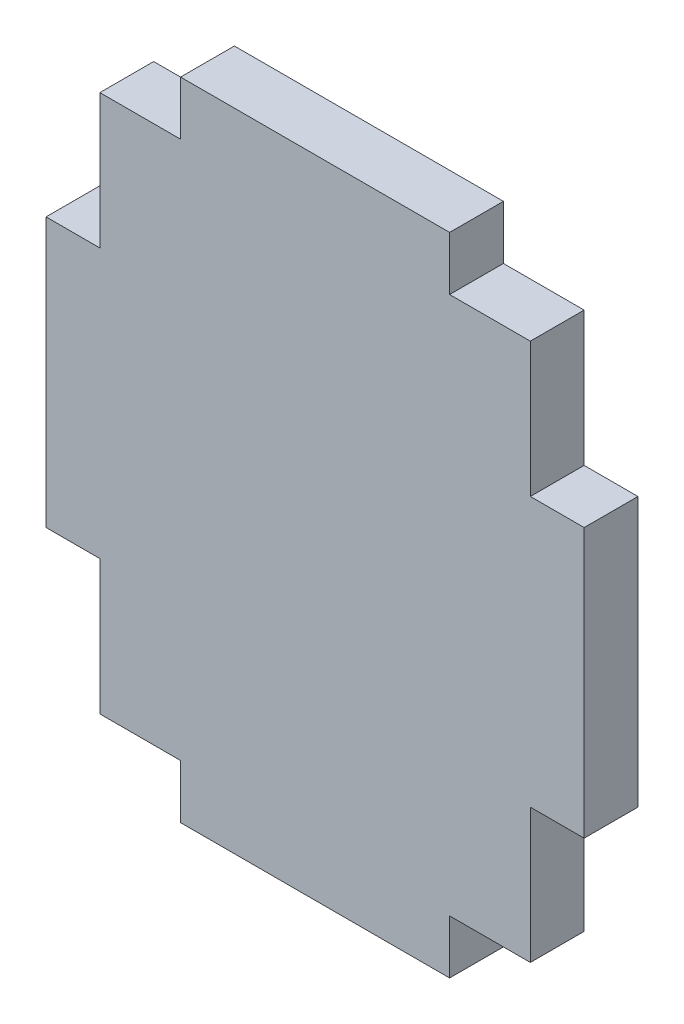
ISO-10303-21;
HEADER;
FILE_DESCRIPTION(('STEP AP214'),'2;1');
FILE_NAME('part.step','',(''),(''),'','','');
FILE_SCHEMA(('AUTOMOTIVE_DESIGN { 1 0 10303 214 1 1 1 1 }'));
ENDSEC;
DATA;
#1=APPLICATION_CONTEXT('core data for automotive mechanical design processes');
#2=APPLICATION_PROTOCOL_DEFINITION('international standard','automotive_design',2000,#1);
#3=PRODUCT_CONTEXT('',#1,'mechanical');
#4=PRODUCT('Part','Part','',(#3));
#5=PRODUCT_RELATED_PRODUCT_CATEGORY('part','',(#4));
#6=PRODUCT_DEFINITION_FORMATION('','',#4);
#7=PRODUCT_DEFINITION_CONTEXT('part definition',#1,'design');
#8=PRODUCT_DEFINITION('design','',#6,#7);
#9=PRODUCT_DEFINITION_SHAPE('','',#8);
#10=(LENGTH_UNIT() NAMED_UNIT(*) SI_UNIT(.MILLI.,.METRE.));
#11=(NAMED_UNIT(*) PLANE_ANGLE_UNIT() SI_UNIT($,.RADIAN.));
#12=(NAMED_UNIT(*) SI_UNIT($,.STERADIAN.) SOLID_ANGLE_UNIT());
#13=UNCERTAINTY_MEASURE_WITH_UNIT(LENGTH_MEASURE(1.E-05),#10,'distance_accuracy_value','');
#14=(GEOMETRIC_REPRESENTATION_CONTEXT(3) GLOBAL_UNCERTAINTY_ASSIGNED_CONTEXT((#13)) GLOBAL_UNIT_ASSIGNED_CONTEXT((#10,
#11,#12)) REPRESENTATION_CONTEXT('',''));
#15=CARTESIAN_POINT('',(0.,0.,0.));
#16=DIRECTION('',(0.,0.,1.));
#17=DIRECTION('',(1.,0.,0.));
#18=AXIS2_PLACEMENT_3D('',#15,#16,#17);
#19=CARTESIAN_POINT('',(27.,25.5,3.));
#20=DIRECTION('',(-1.,0.,0.));
#21=DIRECTION('',(0.,0.,1.));
#22=AXIS2_PLACEMENT_3D('',#19,#20,#21);
#23=PLANE('',#22);
#24=DIRECTION('',(0.,1.,0.));
#25=VECTOR('',#24,1.);
#26=CARTESIAN_POINT('',(27.,25.5,0.));
#27=LINE('',#26,#25);
#28=CARTESIAN_POINT('',(27.,25.5,0.));
#29=VERTEX_POINT('',#28);
#30=CARTESIAN_POINT('',(27.,33.,0.));
#31=VERTEX_POINT('',#30);
#32=EDGE_CURVE('E212',#29,#31,#27,.T.);
#33=ORIENTED_EDGE('',*,*,#32,.T.);
#34=DIRECTION('',(0.,0.,-1.));
#35=VECTOR('',#34,1.);
#36=CARTESIAN_POINT('',(27.,33.,3.));
#37=LINE('',#36,#35);
#38=CARTESIAN_POINT('',(27.,33.,3.));
#39=VERTEX_POINT('',#38);
#40=EDGE_CURVE('E11',#39,#31,#37,.T.);
#41=ORIENTED_EDGE('',*,*,#40,.F.);
#42=DIRECTION('',(0.,1.,0.));
#43=VECTOR('',#42,1.);
#44=CARTESIAN_POINT('',(27.,25.5,3.));
#45=LINE('',#44,#43);
#46=CARTESIAN_POINT('',(27.,25.5,3.));
#47=VERTEX_POINT('',#46);
#48=EDGE_CURVE('E270',#47,#39,#45,.T.);
#49=ORIENTED_EDGE('',*,*,#48,.F.);
#50=DIRECTION('',(0.,0.,-1.));
#51=VECTOR('',#50,1.);
#52=CARTESIAN_POINT('',(27.,25.5,3.));
#53=LINE('',#52,#51);
#54=EDGE_CURVE('E208',#47,#29,#53,.T.);
#55=ORIENTED_EDGE('',*,*,#54,.T.);
#56=EDGE_LOOP('',(#33,#41,#49,#55));
#57=FACE_BOUND('',#56,.T.);
#58=ADVANCED_FACE('F39',(#57),#23,.F.);
#59=CARTESIAN_POINT('',(22.5,33.,3.));
#60=DIRECTION('',(0.,-1.,0.));
#61=DIRECTION('',(0.,0.,-1.));
#62=AXIS2_PLACEMENT_3D('',#59,#60,#61);
#63=PLANE('',#62);
#64=DIRECTION('',(-1.,0.,0.));
#65=VECTOR('',#64,1.);
#66=CARTESIAN_POINT('',(22.5,33.,0.));
#67=LINE('',#66,#65);
#68=CARTESIAN_POINT('',(22.5,33.,0.));
#69=VERTEX_POINT('',#68);
#70=EDGE_CURVE('E216',#31,#69,#67,.T.);
#71=ORIENTED_EDGE('',*,*,#70,.T.);
#72=DIRECTION('',(0.,0.,-1.));
#73=VECTOR('',#72,1.);
#74=CARTESIAN_POINT('',(22.5,33.,3.));
#75=LINE('',#74,#73);
#76=CARTESIAN_POINT('',(22.5,33.,3.));
#77=VERTEX_POINT('',#76);
#78=EDGE_CURVE('E48',#77,#69,#75,.T.);
#79=ORIENTED_EDGE('',*,*,#78,.F.);
#80=DIRECTION('',(-1.,0.,0.));
#81=VECTOR('',#80,1.);
#82=CARTESIAN_POINT('',(22.5,33.,3.));
#83=LINE('',#82,#81);
#84=EDGE_CURVE('E135',#39,#77,#83,.T.);
#85=ORIENTED_EDGE('',*,*,#84,.F.);
#86=ORIENTED_EDGE('',*,*,#40,.T.);
#87=EDGE_LOOP('',(#71,#79,#85,#86));
#88=FACE_BOUND('',#87,.T.);
#89=ADVANCED_FACE('F420',(#88),#63,.F.);
#90=CARTESIAN_POINT('',(22.5,33.,3.));
#91=DIRECTION('',(-1.,0.,0.));
#92=DIRECTION('',(0.,0.,1.));
#93=AXIS2_PLACEMENT_3D('',#90,#91,#92);
#94=PLANE('',#93);
#95=DIRECTION('',(0.,1.,0.));
#96=VECTOR('',#95,1.);
#97=CARTESIAN_POINT('',(22.5,33.,0.));
#98=LINE('',#97,#96);
#99=CARTESIAN_POINT('',(22.5,36.,0.));
#100=VERTEX_POINT('',#99);
#101=EDGE_CURVE('E219',#69,#100,#98,.T.);
#102=ORIENTED_EDGE('',*,*,#101,.T.);
#103=DIRECTION('',(0.,0.,-1.));
#104=VECTOR('',#103,1.);
#105=CARTESIAN_POINT('',(22.5,36.,3.));
#106=LINE('',#105,#104);
#107=CARTESIAN_POINT('',(22.5,36.,3.));
#108=VERTEX_POINT('',#107);
#109=EDGE_CURVE('E329',#108,#100,#106,.T.);
#110=ORIENTED_EDGE('',*,*,#109,.F.);
#111=DIRECTION('',(0.,1.,0.));
#112=VECTOR('',#111,1.);
#113=CARTESIAN_POINT('',(22.5,33.,3.));
#114=LINE('',#113,#112);
#115=EDGE_CURVE('E339',#77,#108,#114,.T.);
#116=ORIENTED_EDGE('',*,*,#115,.F.);
#117=ORIENTED_EDGE('',*,*,#78,.T.);
#118=EDGE_LOOP('',(#102,#110,#116,#117));
#119=FACE_BOUND('',#118,.T.);
#120=ADVANCED_FACE('F337',(#119),#94,.F.);
#121=CARTESIAN_POINT('',(7.5,36.,3.));
#122=DIRECTION('',(0.,-1.,0.));
#123=DIRECTION('',(0.,0.,-1.));
#124=AXIS2_PLACEMENT_3D('',#121,#122,#123);
#125=PLANE('',#124);
#126=DIRECTION('',(-1.,0.,0.));
#127=VECTOR('',#126,1.);
#128=CARTESIAN_POINT('',(7.5,36.,0.));
#129=LINE('',#128,#127);
#130=CARTESIAN_POINT('',(7.5,36.,0.));
#131=VERTEX_POINT('',#130);
#132=EDGE_CURVE('E222',#100,#131,#129,.T.);
#133=ORIENTED_EDGE('',*,*,#132,.T.);
#134=DIRECTION('',(0.,0.,-1.));
#135=VECTOR('',#134,1.);
#136=CARTESIAN_POINT('',(7.5,36.,3.));
#137=LINE('',#136,#135);
#138=CARTESIAN_POINT('',(7.5,36.,3.));
#139=VERTEX_POINT('',#138);
#140=EDGE_CURVE('E325',#139,#131,#137,.T.);
#141=ORIENTED_EDGE('',*,*,#140,.F.);
#142=DIRECTION('',(-1.,0.,0.));
#143=VECTOR('',#142,1.);
#144=CARTESIAN_POINT('',(7.5,36.,3.));
#145=LINE('',#144,#143);
#146=EDGE_CURVE('E358',#108,#139,#145,.T.);
#147=ORIENTED_EDGE('',*,*,#146,.F.);
#148=ORIENTED_EDGE('',*,*,#109,.T.);
#149=EDGE_LOOP('',(#133,#141,#147,#148));
#150=FACE_BOUND('',#149,.T.);
#151=ADVANCED_FACE('F348',(#150),#125,.F.);
#152=CARTESIAN_POINT('',(7.5,33.,3.));
#153=DIRECTION('',(1.,0.,0.));
#154=DIRECTION('',(0.,0.,-1.));
#155=AXIS2_PLACEMENT_3D('',#152,#153,#154);
#156=PLANE('',#155);
#157=DIRECTION('',(0.,-1.,0.));
#158=VECTOR('',#157,1.);
#159=CARTESIAN_POINT('',(7.5,33.,0.));
#160=LINE('',#159,#158);
#161=CARTESIAN_POINT('',(7.5,33.,0.));
#162=VERTEX_POINT('',#161);
#163=EDGE_CURVE('E225',#131,#162,#160,.T.);
#164=ORIENTED_EDGE('',*,*,#163,.T.);
#165=DIRECTION('',(0.,0.,-1.));
#166=VECTOR('',#165,1.);
#167=CARTESIAN_POINT('',(7.5,33.,3.));
#168=LINE('',#167,#166);
#169=CARTESIAN_POINT('',(7.5,33.,3.));
#170=VERTEX_POINT('',#169);
#171=EDGE_CURVE('E321',#170,#162,#168,.T.);
#172=ORIENTED_EDGE('',*,*,#171,.F.);
#173=DIRECTION('',(0.,-1.,0.));
#174=VECTOR('',#173,1.);
#175=CARTESIAN_POINT('',(7.5,33.,3.));
#176=LINE('',#175,#174);
#177=EDGE_CURVE('E354',#139,#170,#176,.T.);
#178=ORIENTED_EDGE('',*,*,#177,.F.);
#179=ORIENTED_EDGE('',*,*,#140,.T.);
#180=EDGE_LOOP('',(#164,#172,#178,#179));
#181=FACE_BOUND('',#180,.T.);
#182=ADVANCED_FACE('F352',(#181),#156,.F.);
#183=CARTESIAN_POINT('',(7.5,33.,3.));
#184=DIRECTION('',(0.,-1.,0.));
#185=DIRECTION('',(0.,0.,-1.));
#186=AXIS2_PLACEMENT_3D('',#183,#184,#185);
#187=PLANE('',#186);
#188=DIRECTION('',(-1.,0.,0.));
#189=VECTOR('',#188,1.);
#190=CARTESIAN_POINT('',(7.5,33.,0.));
#191=LINE('',#190,#189);
#192=CARTESIAN_POINT('',(3.,33.,0.));
#193=VERTEX_POINT('',#192);
#194=EDGE_CURVE('E228',#162,#193,#191,.T.);
#195=ORIENTED_EDGE('',*,*,#194,.T.);
#196=DIRECTION('',(0.,0.,-1.));
#197=VECTOR('',#196,1.);
#198=CARTESIAN_POINT('',(3.,33.,3.));
#199=LINE('',#198,#197);
#200=CARTESIAN_POINT('',(3.,33.,3.));
#201=VERTEX_POINT('',#200);
#202=EDGE_CURVE('E317',#201,#193,#199,.T.);
#203=ORIENTED_EDGE('',*,*,#202,.F.);
#204=DIRECTION('',(-1.,0.,0.));
#205=VECTOR('',#204,1.);
#206=CARTESIAN_POINT('',(7.5,33.,3.));
#207=LINE('',#206,#205);
#208=EDGE_CURVE('E357',#170,#201,#207,.T.);
#209=ORIENTED_EDGE('',*,*,#208,.F.);
#210=ORIENTED_EDGE('',*,*,#171,.T.);
#211=EDGE_LOOP('',(#195,#203,#209,#210));
#212=FACE_BOUND('',#211,.T.);
#213=ADVANCED_FACE('F433',(#212),#187,.F.);
#214=CARTESIAN_POINT('',(3.,33.,3.));
#215=DIRECTION('',(1.,0.,0.));
#216=DIRECTION('',(0.,1.,0.));
#217=AXIS2_PLACEMENT_3D('',#214,#215,#216);
#218=PLANE('',#217);
#219=DIRECTION('',(0.,-1.,0.));
#220=VECTOR('',#219,1.);
#221=CARTESIAN_POINT('',(3.,33.,0.));
#222=LINE('',#221,#220);
#223=CARTESIAN_POINT('',(3.,25.5,0.));
#224=VERTEX_POINT('',#223);
#225=EDGE_CURVE('E231',#193,#224,#222,.T.);
#226=ORIENTED_EDGE('',*,*,#225,.T.);
#227=DIRECTION('',(0.,0.,-1.));
#228=VECTOR('',#227,1.);
#229=CARTESIAN_POINT('',(3.,25.5,3.));
#230=LINE('',#229,#228);
#231=CARTESIAN_POINT('',(3.,25.5,3.));
#232=VERTEX_POINT('',#231);
#233=EDGE_CURVE('E313',#232,#224,#230,.T.);
#234=ORIENTED_EDGE('',*,*,#233,.F.);
#235=DIRECTION('',(0.,-1.,0.));
#236=VECTOR('',#235,1.);
#237=CARTESIAN_POINT('',(3.,33.,3.));
#238=LINE('',#237,#236);
#239=EDGE_CURVE('E362',#201,#232,#238,.T.);
#240=ORIENTED_EDGE('',*,*,#239,.F.);
#241=ORIENTED_EDGE('',*,*,#202,.T.);
#242=EDGE_LOOP('',(#226,#234,#240,#241));
#243=FACE_BOUND('',#242,.T.);
#244=ADVANCED_FACE('F436',(#243),#218,.F.);
#245=CARTESIAN_POINT('',(3.,25.5,3.));
#246=DIRECTION('',(0.,-1.,0.));
#247=DIRECTION('',(0.,0.,-1.));
#248=AXIS2_PLACEMENT_3D('',#245,#246,#247);
#249=PLANE('',#248);
#250=DIRECTION('',(-1.,0.,0.));
#251=VECTOR('',#250,1.);
#252=CARTESIAN_POINT('',(3.,25.5,0.));
#253=LINE('',#252,#251);
#254=CARTESIAN_POINT('',(0.,25.5,0.));
#255=VERTEX_POINT('',#254);
#256=EDGE_CURVE('E234',#224,#255,#253,.T.);
#257=ORIENTED_EDGE('',*,*,#256,.T.);
#258=DIRECTION('',(0.,0.,-1.));
#259=VECTOR('',#258,1.);
#260=CARTESIAN_POINT('',(0.,25.5,3.));
#261=LINE('',#260,#259);
#262=CARTESIAN_POINT('',(0.,25.5,3.));
#263=VERTEX_POINT('',#262);
#264=EDGE_CURVE('E309',#263,#255,#261,.T.);
#265=ORIENTED_EDGE('',*,*,#264,.F.);
#266=DIRECTION('',(-1.,0.,0.));
#267=VECTOR('',#266,1.);
#268=CARTESIAN_POINT('',(3.,25.5,3.));
#269=LINE('',#268,#267);
#270=EDGE_CURVE('E369',#232,#263,#269,.T.);
#271=ORIENTED_EDGE('',*,*,#270,.F.);
#272=ORIENTED_EDGE('',*,*,#233,.T.);
#273=EDGE_LOOP('',(#257,#265,#271,#272));
#274=FACE_BOUND('',#273,.T.);
#275=ADVANCED_FACE('F440',(#274),#249,.F.);
#276=CARTESIAN_POINT('',(0.,10.5,3.));
#277=DIRECTION('',(1.,0.,0.));
#278=DIRECTION('',(0.,0.,-1.));
#279=AXIS2_PLACEMENT_3D('',#276,#277,#278);
#280=PLANE('',#279);
#281=DIRECTION('',(0.,-1.,0.));
#282=VECTOR('',#281,1.);
#283=CARTESIAN_POINT('',(0.,10.5,0.));
#284=LINE('',#283,#282);
#285=CARTESIAN_POINT('',(0.,10.5,0.));
#286=VERTEX_POINT('',#285);
#287=EDGE_CURVE('E237',#255,#286,#284,.T.);
#288=ORIENTED_EDGE('',*,*,#287,.T.);
#289=DIRECTION('',(0.,0.,-1.));
#290=VECTOR('',#289,1.);
#291=CARTESIAN_POINT('',(0.,10.5,3.));
#292=LINE('',#291,#290);
#293=CARTESIAN_POINT('',(0.,10.5,3.));
#294=VERTEX_POINT('',#293);
#295=EDGE_CURVE('E305',#294,#286,#292,.T.);
#296=ORIENTED_EDGE('',*,*,#295,.F.);
#297=DIRECTION('',(0.,-1.,0.));
#298=VECTOR('',#297,1.);
#299=CARTESIAN_POINT('',(0.,10.5,3.));
#300=LINE('',#299,#298);
#301=EDGE_CURVE('E372',#263,#294,#300,.T.);
#302=ORIENTED_EDGE('',*,*,#301,.F.);
#303=ORIENTED_EDGE('',*,*,#264,.T.);
#304=EDGE_LOOP('',(#288,#296,#302,#303));
#305=FACE_BOUND('',#304,.T.);
#306=ADVANCED_FACE('F444',(#305),#280,.F.);
#307=CARTESIAN_POINT('',(3.,10.5,3.));
#308=DIRECTION('',(0.,1.,0.));
#309=DIRECTION('',(0.,0.,1.));
#310=AXIS2_PLACEMENT_3D('',#307,#308,#309);
#311=PLANE('',#310);
#312=DIRECTION('',(1.,0.,0.));
#313=VECTOR('',#312,1.);
#314=CARTESIAN_POINT('',(3.,10.5,0.));
#315=LINE('',#314,#313);
#316=CARTESIAN_POINT('',(3.,10.5,0.));
#317=VERTEX_POINT('',#316);
#318=EDGE_CURVE('E240',#286,#317,#315,.T.);
#319=ORIENTED_EDGE('',*,*,#318,.T.);
#320=DIRECTION('',(0.,0.,-1.));
#321=VECTOR('',#320,1.);
#322=CARTESIAN_POINT('',(3.,10.5,3.));
#323=LINE('',#322,#321);
#324=CARTESIAN_POINT('',(3.,10.5,3.));
#325=VERTEX_POINT('',#324);
#326=EDGE_CURVE('E301',#325,#317,#323,.T.);
#327=ORIENTED_EDGE('',*,*,#326,.F.);
#328=DIRECTION('',(1.,0.,0.));
#329=VECTOR('',#328,1.);
#330=CARTESIAN_POINT('',(3.,10.5,3.));
#331=LINE('',#330,#329);
#332=EDGE_CURVE('E375',#294,#325,#331,.T.);
#333=ORIENTED_EDGE('',*,*,#332,.F.);
#334=ORIENTED_EDGE('',*,*,#295,.T.);
#335=EDGE_LOOP('',(#319,#327,#333,#334));
#336=FACE_BOUND('',#335,.T.);
#337=ADVANCED_FACE('F448',(#336),#311,.F.);
#338=CARTESIAN_POINT('',(3.,10.5,3.));
#339=DIRECTION('',(1.,0.,0.));
#340=DIRECTION('',(0.,0.,-1.));
#341=AXIS2_PLACEMENT_3D('',#338,#339,#340);
#342=PLANE('',#341);
#343=DIRECTION('',(0.,-1.,0.));
#344=VECTOR('',#343,1.);
#345=CARTESIAN_POINT('',(3.,10.5,0.));
#346=LINE('',#345,#344);
#347=CARTESIAN_POINT('',(3.,3.,0.));
#348=VERTEX_POINT('',#347);
#349=EDGE_CURVE('E243',#317,#348,#346,.T.);
#350=ORIENTED_EDGE('',*,*,#349,.T.);
#351=DIRECTION('',(0.,0.,-1.));
#352=VECTOR('',#351,1.);
#353=CARTESIAN_POINT('',(3.,3.,3.));
#354=LINE('',#353,#352);
#355=CARTESIAN_POINT('',(3.,3.,3.));
#356=VERTEX_POINT('',#355);
#357=EDGE_CURVE('E297',#356,#348,#354,.T.);
#358=ORIENTED_EDGE('',*,*,#357,.F.);
#359=DIRECTION('',(0.,-1.,0.));
#360=VECTOR('',#359,1.);
#361=CARTESIAN_POINT('',(3.,10.5,3.));
#362=LINE('',#361,#360);
#363=EDGE_CURVE('E378',#325,#356,#362,.T.);
#364=ORIENTED_EDGE('',*,*,#363,.F.);
#365=ORIENTED_EDGE('',*,*,#326,.T.);
#366=EDGE_LOOP('',(#350,#358,#364,#365));
#367=FACE_BOUND('',#366,.T.);
#368=ADVANCED_FACE('F452',(#367),#342,.F.);
#369=CARTESIAN_POINT('',(7.5,3.,3.));
#370=DIRECTION('',(0.,1.,0.));
#371=DIRECTION('',(0.,0.,1.));
#372=AXIS2_PLACEMENT_3D('',#369,#370,#371);
#373=PLANE('',#372);
#374=DIRECTION('',(1.,0.,0.));
#375=VECTOR('',#374,1.);
#376=CARTESIAN_POINT('',(7.5,3.,0.));
#377=LINE('',#376,#375);
#378=CARTESIAN_POINT('',(7.5,3.,0.));
#379=VERTEX_POINT('',#378);
#380=EDGE_CURVE('E246',#348,#379,#377,.T.);
#381=ORIENTED_EDGE('',*,*,#380,.T.);
#382=DIRECTION('',(0.,0.,-1.));
#383=VECTOR('',#382,1.);
#384=CARTESIAN_POINT('',(7.5,3.,3.));
#385=LINE('',#384,#383);
#386=CARTESIAN_POINT('',(7.5,3.,3.));
#387=VERTEX_POINT('',#386);
#388=EDGE_CURVE('E293',#387,#379,#385,.T.);
#389=ORIENTED_EDGE('',*,*,#388,.F.);
#390=DIRECTION('',(1.,0.,0.));
#391=VECTOR('',#390,1.);
#392=CARTESIAN_POINT('',(7.5,3.,3.));
#393=LINE('',#392,#391);
#394=EDGE_CURVE('E381',#356,#387,#393,.T.);
#395=ORIENTED_EDGE('',*,*,#394,.F.);
#396=ORIENTED_EDGE('',*,*,#357,.T.);
#397=EDGE_LOOP('',(#381,#389,#395,#396));
#398=FACE_BOUND('',#397,.T.);
#399=ADVANCED_FACE('F456',(#398),#373,.F.);
#400=CARTESIAN_POINT('',(7.5,3.,3.));
#401=DIRECTION('',(1.,0.,0.));
#402=DIRECTION('',(0.,0.,-1.));
#403=AXIS2_PLACEMENT_3D('',#400,#401,#402);
#404=PLANE('',#403);
#405=DIRECTION('',(0.,-1.,0.));
#406=VECTOR('',#405,1.);
#407=CARTESIAN_POINT('',(7.5,3.,0.));
#408=LINE('',#407,#406);
#409=CARTESIAN_POINT('',(7.5,0.,0.));
#410=VERTEX_POINT('',#409);
#411=EDGE_CURVE('E249',#379,#410,#408,.T.);
#412=ORIENTED_EDGE('',*,*,#411,.T.);
#413=DIRECTION('',(0.,0.,-1.));
#414=VECTOR('',#413,1.);
#415=CARTESIAN_POINT('',(7.5,0.,3.));
#416=LINE('',#415,#414);
#417=CARTESIAN_POINT('',(7.5,0.,3.));
#418=VERTEX_POINT('',#417);
#419=EDGE_CURVE('E289',#418,#410,#416,.T.);
#420=ORIENTED_EDGE('',*,*,#419,.F.);
#421=DIRECTION('',(0.,-1.,0.));
#422=VECTOR('',#421,1.);
#423=CARTESIAN_POINT('',(7.5,3.,3.));
#424=LINE('',#423,#422);
#425=EDGE_CURVE('E384',#387,#418,#424,.T.);
#426=ORIENTED_EDGE('',*,*,#425,.F.);
#427=ORIENTED_EDGE('',*,*,#388,.T.);
#428=EDGE_LOOP('',(#412,#420,#426,#427));
#429=FACE_BOUND('',#428,.T.);
#430=ADVANCED_FACE('F460',(#429),#404,.F.);
#431=CARTESIAN_POINT('',(7.5,0.,3.));
#432=DIRECTION('',(0.,1.,0.));
#433=DIRECTION('',(0.,0.,1.));
#434=AXIS2_PLACEMENT_3D('',#431,#432,#433);
#435=PLANE('',#434);
#436=DIRECTION('',(1.,0.,0.));
#437=VECTOR('',#436,1.);
#438=CARTESIAN_POINT('',(7.5,0.,0.));
#439=LINE('',#438,#437);
#440=CARTESIAN_POINT('',(22.5,0.,0.));
#441=VERTEX_POINT('',#440);
#442=EDGE_CURVE('E252',#410,#441,#439,.T.);
#443=ORIENTED_EDGE('',*,*,#442,.T.);
#444=DIRECTION('',(0.,0.,-1.));
#445=VECTOR('',#444,1.);
#446=CARTESIAN_POINT('',(22.5,0.,3.));
#447=LINE('',#446,#445);
#448=CARTESIAN_POINT('',(22.5,0.,3.));
#449=VERTEX_POINT('',#448);
#450=EDGE_CURVE('E285',#449,#441,#447,.T.);
#451=ORIENTED_EDGE('',*,*,#450,.F.);
#452=DIRECTION('',(1.,0.,0.));
#453=VECTOR('',#452,1.);
#454=CARTESIAN_POINT('',(7.5,0.,3.));
#455=LINE('',#454,#453);
#456=EDGE_CURVE('E387',#418,#449,#455,.T.);
#457=ORIENTED_EDGE('',*,*,#456,.F.);
#458=ORIENTED_EDGE('',*,*,#419,.T.);
#459=EDGE_LOOP('',(#443,#451,#457,#458));
#460=FACE_BOUND('',#459,.T.);
#461=ADVANCED_FACE('F464',(#460),#435,.F.);
#462=CARTESIAN_POINT('',(22.5,3.,3.));
#463=DIRECTION('',(-1.,0.,0.));
#464=DIRECTION('',(0.,0.,1.));
#465=AXIS2_PLACEMENT_3D('',#462,#463,#464);
#466=PLANE('',#465);
#467=DIRECTION('',(0.,1.,0.));
#468=VECTOR('',#467,1.);
#469=CARTESIAN_POINT('',(22.5,3.,0.));
#470=LINE('',#469,#468);
#471=CARTESIAN_POINT('',(22.5,3.,0.));
#472=VERTEX_POINT('',#471);
#473=EDGE_CURVE('E255',#441,#472,#470,.T.);
#474=ORIENTED_EDGE('',*,*,#473,.T.);
#475=DIRECTION('',(0.,0.,-1.));
#476=VECTOR('',#475,1.);
#477=CARTESIAN_POINT('',(22.5,3.,3.));
#478=LINE('',#477,#476);
#479=CARTESIAN_POINT('',(22.5,3.,3.));
#480=VERTEX_POINT('',#479);
#481=EDGE_CURVE('E281',#480,#472,#478,.T.);
#482=ORIENTED_EDGE('',*,*,#481,.F.);
#483=DIRECTION('',(0.,1.,0.));
#484=VECTOR('',#483,1.);
#485=CARTESIAN_POINT('',(22.5,3.,3.));
#486=LINE('',#485,#484);
#487=EDGE_CURVE('E390',#449,#480,#486,.T.);
#488=ORIENTED_EDGE('',*,*,#487,.F.);
#489=ORIENTED_EDGE('',*,*,#450,.T.);
#490=EDGE_LOOP('',(#474,#482,#488,#489));
#491=FACE_BOUND('',#490,.T.);
#492=ADVANCED_FACE('F468',(#491),#466,.F.);
#493=CARTESIAN_POINT('',(22.5,3.,3.));
#494=DIRECTION('',(0.,1.,0.));
#495=DIRECTION('',(0.,0.,1.));
#496=AXIS2_PLACEMENT_3D('',#493,#494,#495);
#497=PLANE('',#496);
#498=DIRECTION('',(1.,0.,0.));
#499=VECTOR('',#498,1.);
#500=CARTESIAN_POINT('',(22.5,3.,0.));
#501=LINE('',#500,#499);
#502=CARTESIAN_POINT('',(27.,3.,0.));
#503=VERTEX_POINT('',#502);
#504=EDGE_CURVE('E258',#472,#503,#501,.T.);
#505=ORIENTED_EDGE('',*,*,#504,.T.);
#506=DIRECTION('',(0.,0.,-1.));
#507=VECTOR('',#506,1.);
#508=CARTESIAN_POINT('',(27.,3.,3.));
#509=LINE('',#508,#507);
#510=CARTESIAN_POINT('',(27.,3.,3.));
#511=VERTEX_POINT('',#510);
#512=EDGE_CURVE('E277',#511,#503,#509,.T.);
#513=ORIENTED_EDGE('',*,*,#512,.F.);
#514=DIRECTION('',(1.,0.,0.));
#515=VECTOR('',#514,1.);
#516=CARTESIAN_POINT('',(22.5,3.,3.));
#517=LINE('',#516,#515);
#518=EDGE_CURVE('E393',#480,#511,#517,.T.);
#519=ORIENTED_EDGE('',*,*,#518,.F.);
#520=ORIENTED_EDGE('',*,*,#481,.T.);
#521=EDGE_LOOP('',(#505,#513,#519,#520));
#522=FACE_BOUND('',#521,.T.);
#523=ADVANCED_FACE('F401',(#522),#497,.F.);
#524=CARTESIAN_POINT('',(27.,10.5,3.));
#525=DIRECTION('',(-1.,0.,0.));
#526=DIRECTION('',(0.,0.,1.));
#527=AXIS2_PLACEMENT_3D('',#524,#525,#526);
#528=PLANE('',#527);
#529=DIRECTION('',(0.,1.,0.));
#530=VECTOR('',#529,1.);
#531=CARTESIAN_POINT('',(27.,10.5,0.));
#532=LINE('',#531,#530);
#533=CARTESIAN_POINT('',(27.,10.5,0.));
#534=VERTEX_POINT('',#533);
#535=EDGE_CURVE('E261',#503,#534,#532,.T.);
#536=ORIENTED_EDGE('',*,*,#535,.T.);
#537=DIRECTION('',(0.,0.,-1.));
#538=VECTOR('',#537,1.);
#539=CARTESIAN_POINT('',(27.,10.5,3.));
#540=LINE('',#539,#538);
#541=CARTESIAN_POINT('',(27.,10.5,3.));
#542=VERTEX_POINT('',#541);
#543=EDGE_CURVE('E201',#542,#534,#540,.T.);
#544=ORIENTED_EDGE('',*,*,#543,.F.);
#545=DIRECTION('',(0.,1.,0.));
#546=VECTOR('',#545,1.);
#547=CARTESIAN_POINT('',(27.,10.5,3.));
#548=LINE('',#547,#546);
#549=EDGE_CURVE('E190',#511,#542,#548,.T.);
#550=ORIENTED_EDGE('',*,*,#549,.F.);
#551=ORIENTED_EDGE('',*,*,#512,.T.);
#552=EDGE_LOOP('',(#536,#544,#550,#551));
#553=FACE_BOUND('',#552,.T.);
#554=ADVANCED_FACE('F405',(#553),#528,.F.);
#555=CARTESIAN_POINT('',(27.,10.5,3.));
#556=DIRECTION('',(0.,1.,0.));
#557=DIRECTION('',(0.,0.,1.));
#558=AXIS2_PLACEMENT_3D('',#555,#556,#557);
#559=PLANE('',#558);
#560=DIRECTION('',(1.,0.,0.));
#561=VECTOR('',#560,1.);
#562=CARTESIAN_POINT('',(27.,10.5,0.));
#563=LINE('',#562,#561);
#564=CARTESIAN_POINT('',(30.,10.5,0.));
#565=VERTEX_POINT('',#564);
#566=EDGE_CURVE('E199',#534,#565,#563,.T.);
#567=ORIENTED_EDGE('',*,*,#566,.T.);
#568=DIRECTION('',(0.,0.,-1.));
#569=VECTOR('',#568,1.);
#570=CARTESIAN_POINT('',(30.,10.5,3.));
#571=LINE('',#570,#569);
#572=CARTESIAN_POINT('',(30.,10.5,3.));
#573=VERTEX_POINT('',#572);
#574=EDGE_CURVE('E196',#573,#565,#571,.T.);
#575=ORIENTED_EDGE('',*,*,#574,.F.);
#576=DIRECTION('',(1.,0.,0.));
#577=VECTOR('',#576,1.);
#578=CARTESIAN_POINT('',(27.,10.5,3.));
#579=LINE('',#578,#577);
#580=EDGE_CURVE('E184',#542,#573,#579,.T.);
#581=ORIENTED_EDGE('',*,*,#580,.F.);
#582=ORIENTED_EDGE('',*,*,#543,.T.);
#583=EDGE_LOOP('',(#567,#575,#581,#582));
#584=FACE_BOUND('',#583,.T.);
#585=ADVANCED_FACE('F197',(#584),#559,.F.);
#586=CARTESIAN_POINT('',(30.,25.5,3.));
#587=DIRECTION('',(-1.,0.,0.));
#588=DIRECTION('',(0.,0.,1.));
#589=AXIS2_PLACEMENT_3D('',#586,#587,#588);
#590=PLANE('',#589);
#591=DIRECTION('',(0.,1.,0.));
#592=VECTOR('',#591,1.);
#593=CARTESIAN_POINT('',(30.,25.5,0.));
#594=LINE('',#593,#592);
#595=CARTESIAN_POINT('',(30.,25.5,0.));
#596=VERTEX_POINT('',#595);
#597=EDGE_CURVE('E121',#565,#596,#594,.T.);
#598=ORIENTED_EDGE('',*,*,#597,.T.);
#599=DIRECTION('',(0.,0.,-1.));
#600=VECTOR('',#599,1.);
#601=CARTESIAN_POINT('',(30.,25.5,3.));
#602=LINE('',#601,#600);
#603=CARTESIAN_POINT('',(30.,25.5,3.));
#604=VERTEX_POINT('',#603);
#605=EDGE_CURVE('E202',#604,#596,#602,.T.);
#606=ORIENTED_EDGE('',*,*,#605,.F.);
#607=DIRECTION('',(0.,1.,0.));
#608=VECTOR('',#607,1.);
#609=CARTESIAN_POINT('',(30.,25.5,3.));
#610=LINE('',#609,#608);
#611=EDGE_CURVE('E188',#573,#604,#610,.T.);
#612=ORIENTED_EDGE('',*,*,#611,.F.);
#613=ORIENTED_EDGE('',*,*,#574,.T.);
#614=EDGE_LOOP('',(#598,#606,#612,#613));
#615=FACE_BOUND('',#614,.T.);
#616=ADVANCED_FACE('F204',(#615),#590,.F.);
#617=CARTESIAN_POINT('',(27.,25.5,3.));
#618=DIRECTION('',(0.,-1.,0.));
#619=DIRECTION('',(0.,0.,-1.));
#620=AXIS2_PLACEMENT_3D('',#617,#618,#619);
#621=PLANE('',#620);
#622=DIRECTION('',(-1.,0.,0.));
#623=VECTOR('',#622,1.);
#624=CARTESIAN_POINT('',(27.,25.5,0.));
#625=LINE('',#624,#623);
#626=EDGE_CURVE('E127',#596,#29,#625,.T.);
#627=ORIENTED_EDGE('',*,*,#626,.T.);
#628=ORIENTED_EDGE('',*,*,#54,.F.);
#629=DIRECTION('',(-1.,0.,0.));
#630=VECTOR('',#629,1.);
#631=CARTESIAN_POINT('',(27.,25.5,3.));
#632=LINE('',#631,#630);
#633=EDGE_CURVE('E56',#604,#47,#632,.T.);
#634=ORIENTED_EDGE('',*,*,#633,.F.);
#635=ORIENTED_EDGE('',*,*,#605,.T.);
#636=EDGE_LOOP('',(#627,#628,#634,#635));
#637=FACE_BOUND('',#636,.T.);
#638=ADVANCED_FACE('F409',(#637),#621,.F.);
#639=CARTESIAN_POINT('',(0.,0.,3.));
#640=DIRECTION('',(0.,0.,-1.));
#641=DIRECTION('',(-1.,0.,0.));
#642=AXIS2_PLACEMENT_3D('',#639,#640,#641);
#643=PLANE('',#642);
#644=ORIENTED_EDGE('',*,*,#48,.T.);
#645=ORIENTED_EDGE('',*,*,#84,.T.);
#646=ORIENTED_EDGE('',*,*,#115,.T.);
#647=ORIENTED_EDGE('',*,*,#146,.T.);
#648=ORIENTED_EDGE('',*,*,#177,.T.);
#649=ORIENTED_EDGE('',*,*,#208,.T.);
#650=ORIENTED_EDGE('',*,*,#239,.T.);
#651=ORIENTED_EDGE('',*,*,#270,.T.);
#652=ORIENTED_EDGE('',*,*,#301,.T.);
#653=ORIENTED_EDGE('',*,*,#332,.T.);
#654=ORIENTED_EDGE('',*,*,#363,.T.);
#655=ORIENTED_EDGE('',*,*,#394,.T.);
#656=ORIENTED_EDGE('',*,*,#425,.T.);
#657=ORIENTED_EDGE('',*,*,#456,.T.);
#658=ORIENTED_EDGE('',*,*,#487,.T.);
#659=ORIENTED_EDGE('',*,*,#518,.T.);
#660=ORIENTED_EDGE('',*,*,#549,.T.);
#661=ORIENTED_EDGE('',*,*,#580,.T.);
#662=ORIENTED_EDGE('',*,*,#611,.T.);
#663=ORIENTED_EDGE('',*,*,#633,.T.);
#664=EDGE_LOOP('',(#644,#645,#646,#647,#648,#649,#650,#651,#652,#653,#654,#655,#656,#657,#658,
#659,#660,#661,#662,#663));
#665=FACE_BOUND('',#664,.T.);
#666=ADVANCED_FACE('F186',(#665),#643,.F.);
#667=CARTESIAN_POINT('',(0.,0.,0.));
#668=DIRECTION('',(0.,0.,-1.));
#669=DIRECTION('',(-1.,0.,0.));
#670=AXIS2_PLACEMENT_3D('',#667,#668,#669);
#671=PLANE('',#670);
#672=ORIENTED_EDGE('',*,*,#32,.F.);
#673=ORIENTED_EDGE('',*,*,#626,.F.);
#674=ORIENTED_EDGE('',*,*,#597,.F.);
#675=ORIENTED_EDGE('',*,*,#566,.F.);
#676=ORIENTED_EDGE('',*,*,#535,.F.);
#677=ORIENTED_EDGE('',*,*,#504,.F.);
#678=ORIENTED_EDGE('',*,*,#473,.F.);
#679=ORIENTED_EDGE('',*,*,#442,.F.);
#680=ORIENTED_EDGE('',*,*,#411,.F.);
#681=ORIENTED_EDGE('',*,*,#380,.F.);
#682=ORIENTED_EDGE('',*,*,#349,.F.);
#683=ORIENTED_EDGE('',*,*,#318,.F.);
#684=ORIENTED_EDGE('',*,*,#287,.F.);
#685=ORIENTED_EDGE('',*,*,#256,.F.);
#686=ORIENTED_EDGE('',*,*,#225,.F.);
#687=ORIENTED_EDGE('',*,*,#194,.F.);
#688=ORIENTED_EDGE('',*,*,#163,.F.);
#689=ORIENTED_EDGE('',*,*,#132,.F.);
#690=ORIENTED_EDGE('',*,*,#101,.F.);
#691=ORIENTED_EDGE('',*,*,#70,.F.);
#692=EDGE_LOOP('',(#672,#673,#674,#675,#676,#677,#678,#679,#680,#681,#682,#683,#684,#685,#686,
#687,#688,#689,#690,#691));
#693=FACE_BOUND('',#692,.T.);
#694=ADVANCED_FACE('F343',(#693),#671,.T.);
#695=CLOSED_SHELL('',(#58,#89,#120,#151,#182,#213,#244,#275,#306,#337,#368,#399,#430,#461,#492,
#523,#554,#585,#616,#638,#666,#694));
#696=MANIFOLD_SOLID_BREP('B2',#695);
#697=ADVANCED_BREP_SHAPE_REPRESENTATION('',(#18,#696),#14);
#698=SHAPE_DEFINITION_REPRESENTATION(#9,#697);
ENDSEC;
END-ISO-10303-21;
